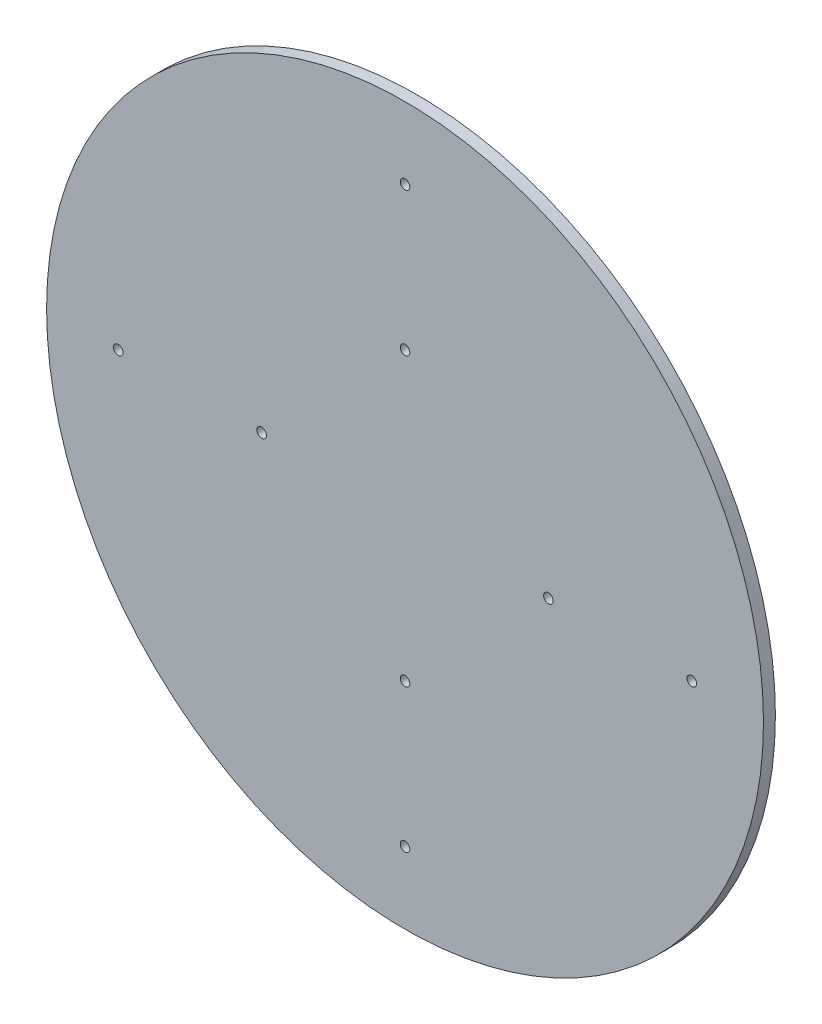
from build123d import *

# Parameters (mm, degrees)
SKETCH2_R                = 150
BOSS_EXTRUDE1_DEPTH      = 5
F_4_0_4_DIAMETER_HOLE1_D = 4
CRVPATTERN1_COUNT        = 2
CRVPATTERN1_PITCH        = 60
CIRPATTERN1_COUNT        = 4
CIRPATTERN1_COPY_1_D     = 4
CIRPATTERN1_COPY_2_D     = 4
CIRPATTERN1_COPY_3_D     = 4


with BuildPart() as part:
    # Sketch2 → Boss-Extrude1 (new body)
    with BuildSketch(Plane.XY):
        Circle(SKETCH2_R)
    extrude(amount=BOSS_EXTRUDE1_DEPTH)

    # 4.0 _4_ Diameter Hole1 (through all)
    with Locations(Plane.XY.offset(5)):
        with Locations((0, 60)):
            f_4_0_4_diameter_hole1 = Hole(F_4_0_4_DIAMETER_HOLE1_D / 2)

    # CrvPattern1: 4.0 _4_ Diameter Hole1 ×2
    with Locations(*[(0, i * CRVPATTERN1_PITCH, 0) for i in range(1, CRVPATTERN1_COUNT)]):
        add(f_4_0_4_diameter_hole1, mode=Mode.SUBTRACT)

    # CirPattern1: 4.0 _4_ Diameter Hole1 ×4 about axis
    cirpattern1_axis = Axis((0, 0, 0), (0, 0, 1))
    for i in range(1, CIRPATTERN1_COUNT):
        add(f_4_0_4_diameter_hole1.rotate(cirpattern1_axis, i * 360 / CIRPATTERN1_COUNT), mode=Mode.SUBTRACT)

    # CirPattern1 copy 1 (through all)
    with Locations(Plane(origin=(-60, 0, 5), x_dir=(0, 1, 0), z_dir=(0, 0, 1))):
        with Locations((0, 60)):
            Hole(CIRPATTERN1_COPY_1_D / 2)

    # CirPattern1 copy 2 (through all)
    with Locations(Plane(origin=(0, -60, 5), x_dir=(-1, 0, 0), z_dir=(0, 0, 1))):
        with Locations((0, 60)):
            Hole(CIRPATTERN1_COPY_2_D / 2)

    # CirPattern1 copy 3 (through all)
    with Locations(Plane(origin=(60, 0, 5), x_dir=(0, -1, 0), z_dir=(0, 0, 1))):
        with Locations((0, 60)):
            Hole(CIRPATTERN1_COPY_3_D / 2)


solid = part.part
